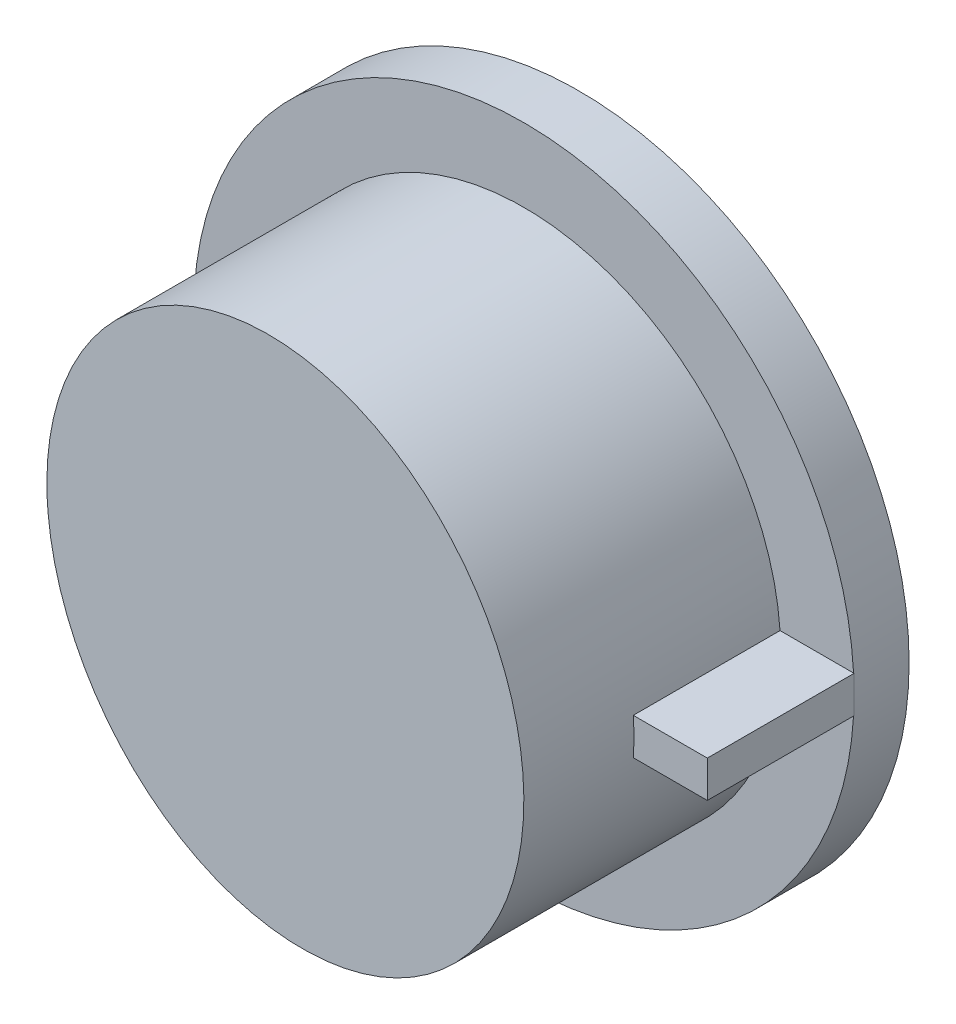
ISO-10303-21;
HEADER;
FILE_DESCRIPTION(('STEP AP214'),'2;1');
FILE_NAME('part.step','',(''),(''),'','','');
FILE_SCHEMA(('AUTOMOTIVE_DESIGN { 1 0 10303 214 1 1 1 1 }'));
ENDSEC;
DATA;
#1=APPLICATION_CONTEXT('core data for automotive mechanical design processes');
#2=APPLICATION_PROTOCOL_DEFINITION('international standard','automotive_design',2000,#1);
#3=PRODUCT_CONTEXT('',#1,'mechanical');
#4=PRODUCT('Part','Part','',(#3));
#5=PRODUCT_RELATED_PRODUCT_CATEGORY('part','',(#4));
#6=PRODUCT_DEFINITION_FORMATION('','',#4);
#7=PRODUCT_DEFINITION_CONTEXT('part definition',#1,'design');
#8=PRODUCT_DEFINITION('design','',#6,#7);
#9=PRODUCT_DEFINITION_SHAPE('','',#8);
#10=(LENGTH_UNIT() NAMED_UNIT(*) SI_UNIT(.MILLI.,.METRE.));
#11=(NAMED_UNIT(*) PLANE_ANGLE_UNIT() SI_UNIT($,.RADIAN.));
#12=(NAMED_UNIT(*) SI_UNIT($,.STERADIAN.) SOLID_ANGLE_UNIT());
#13=UNCERTAINTY_MEASURE_WITH_UNIT(LENGTH_MEASURE(1.E-05),#10,'distance_accuracy_value','');
#14=(GEOMETRIC_REPRESENTATION_CONTEXT(3) GLOBAL_UNCERTAINTY_ASSIGNED_CONTEXT((#13)) GLOBAL_UNIT_ASSIGNED_CONTEXT((#10,
#11,#12)) REPRESENTATION_CONTEXT('',''));
#15=CARTESIAN_POINT('',(0.,0.,0.));
#16=DIRECTION('',(0.,0.,1.));
#17=DIRECTION('',(1.,0.,0.));
#18=AXIS2_PLACEMENT_3D('',#15,#16,#17);
#19=CARTESIAN_POINT('',(0.,0.,1.5));
#20=DIRECTION('',(0.,0.,1.));
#21=DIRECTION('',(1.,0.,0.));
#22=AXIS2_PLACEMENT_3D('',#19,#20,#21);
#23=PLANE('',#22);
#24=CARTESIAN_POINT('',(0.,0.,1.5));
#25=DIRECTION('',(0.,0.,1.));
#26=DIRECTION('',(1.,0.,0.));
#27=AXIS2_PLACEMENT_3D('',#24,#25,#26);
#28=CIRCLE('',#27,7.);
#29=CARTESIAN_POINT('',(6.98212002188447,0.5,1.5));
#30=VERTEX_POINT('',#29);
#31=CARTESIAN_POINT('',(6.98212002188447,-0.5,1.5));
#32=VERTEX_POINT('',#31);
#33=EDGE_CURVE('E116',#30,#32,#28,.T.);
#34=ORIENTED_EDGE('',*,*,#33,.F.);
#35=DIRECTION('',(-1.,0.,0.));
#36=VECTOR('',#35,1.);
#37=CARTESIAN_POINT('',(6.38459058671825,0.5,1.5));
#38=LINE('',#37,#36);
#39=CARTESIAN_POINT('',(8.98610037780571,0.5,1.5));
#40=VERTEX_POINT('',#39);
#41=EDGE_CURVE('E102',#40,#30,#38,.T.);
#42=ORIENTED_EDGE('',*,*,#41,.F.);
#43=CARTESIAN_POINT('',(0.,0.,1.5));
#44=DIRECTION('',(0.,0.,1.));
#45=DIRECTION('',(1.,0.,0.));
#46=AXIS2_PLACEMENT_3D('',#43,#44,#45);
#47=CIRCLE('',#46,9.);
#48=CARTESIAN_POINT('',(8.98610037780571,-0.5,1.5));
#49=VERTEX_POINT('',#48);
#50=EDGE_CURVE('E122',#40,#49,#47,.T.);
#51=ORIENTED_EDGE('',*,*,#50,.T.);
#52=DIRECTION('',(-1.,0.,0.));
#53=VECTOR('',#52,1.);
#54=CARTESIAN_POINT('',(6.38459058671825,-0.5,1.5));
#55=LINE('',#54,#53);
#56=EDGE_CURVE('E94',#49,#32,#55,.T.);
#57=ORIENTED_EDGE('',*,*,#56,.T.);
#58=EDGE_LOOP('',(#34,#42,#51,#57));
#59=FACE_BOUND('',#58,.T.);
#60=ADVANCED_FACE('F26',(#59),#23,.T.);
#61=CARTESIAN_POINT('',(0.,0.,9.5));
#62=DIRECTION('',(0.,0.,-1.));
#63=DIRECTION('',(-1.,0.,0.));
#64=AXIS2_PLACEMENT_3D('',#61,#62,#63);
#65=CYLINDRICAL_SURFACE('',#64,7.);
#66=CARTESIAN_POINT('',(0.,0.,8.));
#67=DIRECTION('',(0.0712470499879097,0.,-0.997458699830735));
#68=DIRECTION('',(-0.997458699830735,0.,-0.0712470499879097));
#69=AXIS2_PLACEMENT_3D('',#66,#67,#68);
#70=ELLIPSE('',#69,7.0178344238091,7.);
#71=CARTESIAN_POINT('',(-7.,0.,7.5));
#72=VERTEX_POINT('',#71);
#73=EDGE_CURVE('E125',#72,#72,#70,.T.);
#74=ORIENTED_EDGE('',*,*,#73,.T.);
#75=EDGE_LOOP('',(#74));
#76=FACE_BOUND('',#75,.T.);
#77=DIRECTION('',(0.,0.,-1.));
#78=VECTOR('',#77,1.);
#79=CARTESIAN_POINT('',(6.98212002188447,0.5,9.5));
#80=LINE('',#79,#78);
#81=CARTESIAN_POINT('',(6.98212002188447,0.5,5.5));
#82=VERTEX_POINT('',#81);
#83=EDGE_CURVE('E11',#30,#82,#80,.F.);
#84=ORIENTED_EDGE('',*,*,#83,.F.);
#85=ORIENTED_EDGE('',*,*,#33,.T.);
#86=DIRECTION('',(0.,0.,-1.));
#87=VECTOR('',#86,1.);
#88=CARTESIAN_POINT('',(6.98212002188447,-0.5,9.5));
#89=LINE('',#88,#87);
#90=CARTESIAN_POINT('',(6.98212002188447,-0.5,5.5));
#91=VERTEX_POINT('',#90);
#92=EDGE_CURVE('E128',#32,#91,#89,.F.);
#93=ORIENTED_EDGE('',*,*,#92,.T.);
#94=CARTESIAN_POINT('',(0.,0.,5.5));
#95=DIRECTION('',(0.,0.,-1.));
#96=DIRECTION('',(-1.,0.,0.));
#97=AXIS2_PLACEMENT_3D('',#94,#95,#96);
#98=CIRCLE('',#97,7.);
#99=EDGE_CURVE('E34',#82,#91,#98,.T.);
#100=ORIENTED_EDGE('',*,*,#99,.F.);
#101=EDGE_LOOP('',(#84,#85,#93,#100));
#102=FACE_BOUND('',#101,.T.);
#103=ADVANCED_FACE('F131',(#76,#102),#65,.T.);
#104=CARTESIAN_POINT('',(0.,0.,1.5));
#105=DIRECTION('',(0.,0.,-1.));
#106=DIRECTION('',(-1.,0.,0.));
#107=AXIS2_PLACEMENT_3D('',#104,#105,#106);
#108=CYLINDRICAL_SURFACE('',#107,9.);
#109=CARTESIAN_POINT('',(9.,0.,1.5));
#110=VERTEX_POINT('',#109);
#111=EDGE_CURVE('E123',#110,#40,#47,.T.);
#112=ORIENTED_EDGE('',*,*,#111,.F.);
#113=CARTESIAN_POINT('',(0.,0.,1.5));
#114=DIRECTION('',(0.,0.,1.));
#115=DIRECTION('',(1.,0.,0.));
#116=AXIS2_PLACEMENT_3D('',#113,#114,#115);
#117=CIRCLE('',#116,9.);
#118=EDGE_CURVE('E49',#49,#110,#117,.T.);
#119=ORIENTED_EDGE('',*,*,#118,.F.);
#120=ORIENTED_EDGE('',*,*,#50,.F.);
#121=EDGE_LOOP('',(#112,#119,#120));
#122=FACE_BOUND('',#121,.T.);
#123=CARTESIAN_POINT('',(0.,0.,0.));
#124=DIRECTION('',(0.,0.,1.));
#125=DIRECTION('',(1.,0.,0.));
#126=AXIS2_PLACEMENT_3D('',#123,#124,#125);
#127=CIRCLE('',#126,9.);
#128=CARTESIAN_POINT('',(9.,0.,0.));
#129=VERTEX_POINT('',#128);
#130=EDGE_CURVE('E119',#129,#129,#127,.T.);
#131=ORIENTED_EDGE('',*,*,#130,.T.);
#132=EDGE_LOOP('',(#131));
#133=FACE_BOUND('',#132,.T.);
#134=ADVANCED_FACE('F28',(#122,#133),#108,.T.);
#135=CARTESIAN_POINT('',(0.,0.,0.));
#136=DIRECTION('',(0.,0.,1.));
#137=DIRECTION('',(1.,0.,0.));
#138=AXIS2_PLACEMENT_3D('',#135,#136,#137);
#139=PLANE('',#138);
#140=CARTESIAN_POINT('',(0.,0.,0.));
#141=DIRECTION('',(0.,0.,-1.));
#142=DIRECTION('',(-1.,0.,0.));
#143=AXIS2_PLACEMENT_3D('',#140,#141,#142);
#144=CIRCLE('',#143,6.);
#145=CARTESIAN_POINT('',(-6.,0.,0.));
#146=VERTEX_POINT('',#145);
#147=EDGE_CURVE('E110',#146,#146,#144,.T.);
#148=ORIENTED_EDGE('',*,*,#147,.F.);
#149=EDGE_LOOP('',(#148));
#150=FACE_BOUND('',#149,.T.);
#151=ORIENTED_EDGE('',*,*,#130,.F.);
#152=EDGE_LOOP('',(#151));
#153=FACE_BOUND('',#152,.T.);
#154=ADVANCED_FACE('F162',(#150,#153),#139,.F.);
#155=CARTESIAN_POINT('',(-7.,-9.,7.5));
#156=DIRECTION('',(0.0712470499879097,0.,-0.997458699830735));
#157=DIRECTION('',(-0.997458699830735,0.,-0.0712470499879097));
#158=AXIS2_PLACEMENT_3D('',#155,#156,#157);
#159=PLANE('',#158);
#160=ORIENTED_EDGE('',*,*,#73,.F.);
#161=EDGE_LOOP('',(#160));
#162=FACE_BOUND('',#161,.T.);
#163=ADVANCED_FACE('F164',(#162),#159,.F.);
#164=CARTESIAN_POINT('',(0.,0.,6.));
#165=DIRECTION('',(0.,0.,-1.));
#166=DIRECTION('',(-1.,0.,0.));
#167=AXIS2_PLACEMENT_3D('',#164,#165,#166);
#168=CYLINDRICAL_SURFACE('',#167,6.);
#169=CARTESIAN_POINT('',(0.,0.,6.));
#170=DIRECTION('',(0.,0.,-1.));
#171=DIRECTION('',(-1.,0.,0.));
#172=AXIS2_PLACEMENT_3D('',#169,#170,#171);
#173=CIRCLE('',#172,6.);
#174=CARTESIAN_POINT('',(-6.,0.,6.));
#175=VERTEX_POINT('',#174);
#176=EDGE_CURVE('E113',#175,#175,#173,.T.);
#177=ORIENTED_EDGE('',*,*,#176,.F.);
#178=EDGE_LOOP('',(#177));
#179=FACE_BOUND('',#178,.T.);
#180=ORIENTED_EDGE('',*,*,#147,.T.);
#181=EDGE_LOOP('',(#180));
#182=FACE_BOUND('',#181,.T.);
#183=ADVANCED_FACE('F169',(#179,#182),#168,.F.);
#184=CARTESIAN_POINT('',(0.,0.,6.));
#185=DIRECTION('',(0.,0.,-1.));
#186=DIRECTION('',(-1.,0.,0.));
#187=AXIS2_PLACEMENT_3D('',#184,#185,#186);
#188=PLANE('',#187);
#189=ORIENTED_EDGE('',*,*,#176,.T.);
#190=EDGE_LOOP('',(#189));
#191=FACE_BOUND('',#190,.T.);
#192=ADVANCED_FACE('F173',(#191),#188,.T.);
#193=CARTESIAN_POINT('',(9.,0.5,5.5));
#194=DIRECTION('',(0.,0.,-1.));
#195=DIRECTION('',(-1.,0.,0.));
#196=AXIS2_PLACEMENT_3D('',#193,#194,#195);
#197=PLANE('',#196);
#198=DIRECTION('',(1.,0.,0.));
#199=VECTOR('',#198,1.);
#200=CARTESIAN_POINT('',(9.,0.5,5.5));
#201=LINE('',#200,#199);
#202=CARTESIAN_POINT('',(9.,0.5,5.5));
#203=VERTEX_POINT('',#202);
#204=EDGE_CURVE('E99',#82,#203,#201,.T.);
#205=ORIENTED_EDGE('',*,*,#204,.F.);
#206=ORIENTED_EDGE('',*,*,#99,.T.);
#207=DIRECTION('',(1.,0.,0.));
#208=VECTOR('',#207,1.);
#209=CARTESIAN_POINT('',(9.,-0.5,5.5));
#210=LINE('',#209,#208);
#211=CARTESIAN_POINT('',(9.,-0.5,5.5));
#212=VERTEX_POINT('',#211);
#213=EDGE_CURVE('E41',#91,#212,#210,.T.);
#214=ORIENTED_EDGE('',*,*,#213,.T.);
#215=DIRECTION('',(0.,-1.,0.));
#216=VECTOR('',#215,1.);
#217=CARTESIAN_POINT('',(9.,0.5,5.5));
#218=LINE('',#217,#216);
#219=EDGE_CURVE('E78',#203,#212,#218,.T.);
#220=ORIENTED_EDGE('',*,*,#219,.F.);
#221=EDGE_LOOP('',(#205,#206,#214,#220));
#222=FACE_BOUND('',#221,.T.);
#223=ADVANCED_FACE('F77',(#222),#197,.F.);
#224=CARTESIAN_POINT('',(6.38459058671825,0.5,1.5));
#225=DIRECTION('',(0.,0.,1.));
#226=DIRECTION('',(1.,0.,0.));
#227=AXIS2_PLACEMENT_3D('',#224,#225,#226);
#228=PLANE('',#227);
#229=DIRECTION('',(0.,-1.,0.));
#230=VECTOR('',#229,1.);
#231=CARTESIAN_POINT('',(9.,0.5,1.5));
#232=LINE('',#231,#230);
#233=CARTESIAN_POINT('',(9.,0.5,1.5));
#234=VERTEX_POINT('',#233);
#235=EDGE_CURVE('E90',#234,#110,#232,.T.);
#236=ORIENTED_EDGE('',*,*,#235,.T.);
#237=ORIENTED_EDGE('',*,*,#111,.T.);
#238=EDGE_CURVE('E103',#234,#40,#38,.T.);
#239=ORIENTED_EDGE('',*,*,#238,.F.);
#240=EDGE_LOOP('',(#236,#237,#239));
#241=FACE_BOUND('',#240,.T.);
#242=ADVANCED_FACE('F142',(#241),#228,.F.);
#243=CARTESIAN_POINT('',(9.,-0.5,1.5));
#244=VERTEX_POINT('',#243);
#245=EDGE_CURVE('E93',#244,#49,#55,.T.);
#246=ORIENTED_EDGE('',*,*,#245,.T.);
#247=ORIENTED_EDGE('',*,*,#118,.T.);
#248=EDGE_CURVE('E106',#110,#244,#232,.T.);
#249=ORIENTED_EDGE('',*,*,#248,.T.);
#250=EDGE_LOOP('',(#246,#247,#249));
#251=FACE_BOUND('',#250,.T.);
#252=ADVANCED_FACE('F145',(#251),#228,.F.);
#253=CARTESIAN_POINT('',(6.38459058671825,0.5,1.5));
#254=DIRECTION('',(0.,-1.,0.));
#255=DIRECTION('',(0.,0.,-1.));
#256=AXIS2_PLACEMENT_3D('',#253,#254,#255);
#257=PLANE('',#256);
#258=ORIENTED_EDGE('',*,*,#41,.T.);
#259=ORIENTED_EDGE('',*,*,#83,.T.);
#260=ORIENTED_EDGE('',*,*,#204,.T.);
#261=DIRECTION('',(0.,0.,-1.));
#262=VECTOR('',#261,1.);
#263=CARTESIAN_POINT('',(9.,0.5,1.5));
#264=LINE('',#263,#262);
#265=EDGE_CURVE('E89',#203,#234,#264,.T.);
#266=ORIENTED_EDGE('',*,*,#265,.T.);
#267=ORIENTED_EDGE('',*,*,#238,.T.);
#268=EDGE_LOOP('',(#258,#259,#260,#266,#267));
#269=FACE_BOUND('',#268,.T.);
#270=ADVANCED_FACE('F144',(#269),#257,.F.);
#271=CARTESIAN_POINT('',(6.38459058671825,-0.5,1.5));
#272=DIRECTION('',(0.,-1.,0.));
#273=DIRECTION('',(0.,0.,-1.));
#274=AXIS2_PLACEMENT_3D('',#271,#272,#273);
#275=PLANE('',#274);
#276=ORIENTED_EDGE('',*,*,#92,.F.);
#277=ORIENTED_EDGE('',*,*,#56,.F.);
#278=ORIENTED_EDGE('',*,*,#245,.F.);
#279=DIRECTION('',(0.,0.,-1.));
#280=VECTOR('',#279,1.);
#281=CARTESIAN_POINT('',(9.,-0.5,1.5));
#282=LINE('',#281,#280);
#283=EDGE_CURVE('E82',#212,#244,#282,.T.);
#284=ORIENTED_EDGE('',*,*,#283,.F.);
#285=ORIENTED_EDGE('',*,*,#213,.F.);
#286=EDGE_LOOP('',(#276,#277,#278,#284,#285));
#287=FACE_BOUND('',#286,.T.);
#288=ADVANCED_FACE('F92',(#287),#275,.T.);
#289=CARTESIAN_POINT('',(9.,0.5,1.5));
#290=DIRECTION('',(-1.,0.,0.));
#291=DIRECTION('',(0.,0.,1.));
#292=AXIS2_PLACEMENT_3D('',#289,#290,#291);
#293=PLANE('',#292);
#294=ORIENTED_EDGE('',*,*,#283,.T.);
#295=ORIENTED_EDGE('',*,*,#248,.F.);
#296=ORIENTED_EDGE('',*,*,#235,.F.);
#297=ORIENTED_EDGE('',*,*,#265,.F.);
#298=ORIENTED_EDGE('',*,*,#219,.T.);
#299=EDGE_LOOP('',(#294,#295,#296,#297,#298));
#300=FACE_BOUND('',#299,.T.);
#301=ADVANCED_FACE('F86',(#300),#293,.F.);
#302=CLOSED_SHELL('',(#60,#103,#134,#154,#163,#183,#192,#223,#242,#252,#270,#288,#301));
#303=MANIFOLD_SOLID_BREP('B2',#302);
#304=ADVANCED_BREP_SHAPE_REPRESENTATION('',(#18,#303),#14);
#305=SHAPE_DEFINITION_REPRESENTATION(#9,#304);
ENDSEC;
END-ISO-10303-21;
